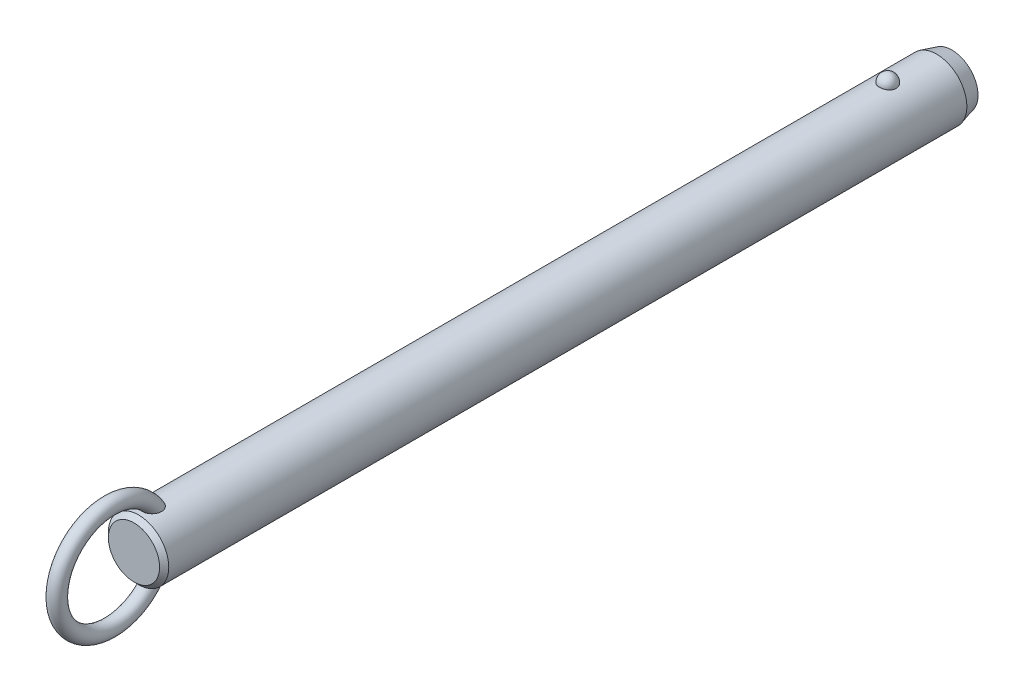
ISO-10303-21;
HEADER;
FILE_DESCRIPTION(('STEP AP214'),'2;1');
FILE_NAME('part.step','',(''),(''),'','','');
FILE_SCHEMA(('AUTOMOTIVE_DESIGN { 1 0 10303 214 1 1 1 1 }'));
ENDSEC;
DATA;
#1=APPLICATION_CONTEXT('core data for automotive mechanical design processes');
#2=APPLICATION_PROTOCOL_DEFINITION('international standard','automotive_design',2000,#1);
#3=PRODUCT_CONTEXT('',#1,'mechanical');
#4=PRODUCT('Part','Part','',(#3));
#5=PRODUCT_RELATED_PRODUCT_CATEGORY('part','',(#4));
#6=PRODUCT_DEFINITION_FORMATION('','',#4);
#7=PRODUCT_DEFINITION_CONTEXT('part definition',#1,'design');
#8=PRODUCT_DEFINITION('design','',#6,#7);
#9=PRODUCT_DEFINITION_SHAPE('','',#8);
#10=(LENGTH_UNIT() NAMED_UNIT(*) SI_UNIT(.MILLI.,.METRE.));
#11=(NAMED_UNIT(*) PLANE_ANGLE_UNIT() SI_UNIT($,.RADIAN.));
#12=(NAMED_UNIT(*) SI_UNIT($,.STERADIAN.) SOLID_ANGLE_UNIT());
#13=UNCERTAINTY_MEASURE_WITH_UNIT(LENGTH_MEASURE(1.E-05),#10,'distance_accuracy_value','');
#14=(GEOMETRIC_REPRESENTATION_CONTEXT(3) GLOBAL_UNCERTAINTY_ASSIGNED_CONTEXT((#13)) GLOBAL_UNIT_ASSIGNED_CONTEXT((#10,
#11,#12)) REPRESENTATION_CONTEXT('',''));
#15=CARTESIAN_POINT('',(0.,0.,0.));
#16=DIRECTION('',(0.,0.,1.));
#17=DIRECTION('',(1.,0.,0.));
#18=AXIS2_PLACEMENT_3D('',#15,#16,#17);
#19=CARTESIAN_POINT('',(0.,0.,185.4));
#20=DIRECTION('',(0.,0.,-1.));
#21=DIRECTION('',(-1.,0.,0.));
#22=AXIS2_PLACEMENT_3D('',#19,#20,#21);
#23=CYLINDRICAL_SURFACE('',#22,7.9);
#24=CARTESIAN_POINT('',(2.1785689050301,7.59367088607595,-2.20000000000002));
#25=CARTESIAN_POINT('',(2.17856679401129,7.59367269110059,-2.07701843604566));
#26=CARTESIAN_POINT('',(2.16853481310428,7.59657145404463,-1.95401006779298));
#27=CARTESIAN_POINT('',(2.12864689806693,7.607843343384,-1.71147811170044));
#28=CARTESIAN_POINT('',(2.09878338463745,7.61621856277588,-1.5919558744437));
#29=CARTESIAN_POINT('',(2.0199931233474,7.63749180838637,-1.35985638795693));
#30=CARTESIAN_POINT('',(1.97107475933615,7.6503878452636,-1.24727610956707));
#31=CARTESIAN_POINT('',(1.85539377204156,7.67926115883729,-1.03213234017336));
#32=CARTESIAN_POINT('',(1.78863158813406,7.69523835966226,-0.929568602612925));
#33=CARTESIAN_POINT('',(1.63856494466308,7.7285848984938,-0.73678633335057));
#34=CARTESIAN_POINT('',(1.55518140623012,7.7459606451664,-0.646630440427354));
#35=CARTESIAN_POINT('',(1.37422937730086,7.78009978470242,-0.481747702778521));
#36=CARTESIAN_POINT('',(1.27666086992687,7.79686317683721,-0.407020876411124));
#37=CARTESIAN_POINT('',(1.07024728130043,7.82786153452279,-0.275278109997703));
#38=CARTESIAN_POINT('',(0.961434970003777,7.84210353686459,-0.218212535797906));
#39=CARTESIAN_POINT('',(0.735351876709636,7.86652194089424,-0.123146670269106));
#40=CARTESIAN_POINT('',(0.618082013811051,7.87669878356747,-0.0851443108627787));
#41=CARTESIAN_POINT('',(0.380637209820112,7.89170521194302,-0.0298158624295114));
#42=CARTESIAN_POINT('',(0.260550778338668,7.89662650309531,-0.0121347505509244));
#43=CARTESIAN_POINT('',(0.0190117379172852,7.90090003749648,0.00324379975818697));
#44=CARTESIAN_POINT('',(-0.102440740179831,7.90025280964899,0.000943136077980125));
#45=CARTESIAN_POINT('',(-0.341452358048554,7.89351056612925,-0.0233955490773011));
#46=CARTESIAN_POINT('',(-0.459042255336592,7.88749257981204,-0.0451545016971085));
#47=CARTESIAN_POINT('',(-0.688796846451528,7.87075812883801,-0.107408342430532));
#48=CARTESIAN_POINT('',(-0.800961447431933,7.86004158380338,-0.14790355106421));
#49=CARTESIAN_POINT('',(-1.01743634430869,7.83497131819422,-0.246799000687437));
#50=CARTESIAN_POINT('',(-1.12169791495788,7.82059709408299,-0.305300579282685));
#51=CARTESIAN_POINT('',(-1.31891765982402,7.78976470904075,-0.43854939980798));
#52=CARTESIAN_POINT('',(-1.41187469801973,7.77330633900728,-0.513298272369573));
#53=CARTESIAN_POINT('',(-1.58577142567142,7.73972434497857,-0.678622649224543));
#54=CARTESIAN_POINT('',(-1.66645140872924,7.72259402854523,-0.769470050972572));
#55=CARTESIAN_POINT('',(-1.81161503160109,7.68983776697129,-0.963538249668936));
#56=CARTESIAN_POINT('',(-1.87609753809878,7.6742119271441,-1.0667599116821));
#57=CARTESIAN_POINT('',(-1.98790138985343,7.6460202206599,-1.28401170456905));
#58=CARTESIAN_POINT('',(-2.03501994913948,7.63349104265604,-1.39815107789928));
#59=CARTESIAN_POINT('',(-2.10986724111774,7.6131449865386,-1.6330178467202));
#60=CARTESIAN_POINT('',(-2.1375965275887,7.60532797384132,-1.75374505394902));
#61=CARTESIAN_POINT('',(-2.17289256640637,7.5953195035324,-1.99782562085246));
#62=CARTESIAN_POINT('',(-2.18054294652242,7.59310471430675,-2.12116592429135));
#63=CARTESIAN_POINT('',(-2.17572919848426,7.59448538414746,-2.36741799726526));
#64=CARTESIAN_POINT('',(-2.1632656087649,7.59808068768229,-2.49032977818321));
#65=CARTESIAN_POINT('',(-2.11865035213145,7.61064035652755,-2.73161015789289));
#66=CARTESIAN_POINT('',(-2.08659579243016,7.61957823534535,-2.84999812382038));
#67=CARTESIAN_POINT('',(-2.00367799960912,7.64179982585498,-3.07955956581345));
#68=CARTESIAN_POINT('',(-1.9528140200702,7.65508371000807,-3.19073275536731));
#69=CARTESIAN_POINT('',(-1.83321113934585,7.68460381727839,-3.40337899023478));
#70=CARTESIAN_POINT('',(-1.76437735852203,7.70085556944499,-3.5047965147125));
#71=CARTESIAN_POINT('',(-1.61069526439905,7.73445734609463,-3.69446912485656));
#72=CARTESIAN_POINT('',(-1.52584634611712,7.75180741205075,-3.78272371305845));
#73=CARTESIAN_POINT('',(-1.34198059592,7.78574608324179,-3.94393987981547));
#74=CARTESIAN_POINT('',(-1.24291308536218,7.80233167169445,-4.01684434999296));
#75=CARTESIAN_POINT('',(-1.03352039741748,7.83281625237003,-4.14489386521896));
#76=CARTESIAN_POINT('',(-0.92319600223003,7.84671543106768,-4.20004014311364));
#77=CARTESIAN_POINT('',(-0.695822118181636,7.87011575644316,-4.29042017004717));
#78=CARTESIAN_POINT('',(-0.578872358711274,7.87966903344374,-4.32589112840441));
#79=CARTESIAN_POINT('',(-0.340410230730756,7.8935652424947,-4.37692226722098));
#80=CARTESIAN_POINT('',(-0.218898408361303,7.89790879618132,-4.39248482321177));
#81=CARTESIAN_POINT('',(0.0228107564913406,7.90087453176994,-4.40314405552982));
#82=CARTESIAN_POINT('',(0.142990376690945,7.89960185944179,-4.39861683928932));
#83=CARTESIAN_POINT('',(0.380829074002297,7.89171262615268,-4.37008293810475));
#84=CARTESIAN_POINT('',(0.498488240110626,7.8850962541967,-4.34607694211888));
#85=CARTESIAN_POINT('',(0.727535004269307,7.86726442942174,-4.27939317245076));
#86=CARTESIAN_POINT('',(0.838944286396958,7.85606616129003,-4.23678512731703));
#87=CARTESIAN_POINT('',(1.05295421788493,7.83025654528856,-4.13408348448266));
#88=CARTESIAN_POINT('',(1.15555431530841,7.81564498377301,-4.07398879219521));
#89=CARTESIAN_POINT('',(1.35076763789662,7.7843022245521,-3.93687432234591));
#90=CARTESIAN_POINT('',(1.4432046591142,7.76754209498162,-3.85961036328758));
#91=CARTESIAN_POINT('',(1.6139111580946,7.73387857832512,-3.69076949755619));
#92=CARTESIAN_POINT('',(1.6921781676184,7.71697516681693,-3.59919010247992));
#93=CARTESIAN_POINT('',(1.83380875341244,7.6845643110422,-3.40247278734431));
#94=CARTESIAN_POINT('',(1.89689280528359,7.66908588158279,-3.29712873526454));
#95=CARTESIAN_POINT('',(2.0047823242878,7.64159441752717,-3.07707931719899));
#96=CARTESIAN_POINT('',(2.0495945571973,7.62958010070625,-2.96237743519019));
#97=CARTESIAN_POINT('',(2.11580183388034,7.61146617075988,-2.74040519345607));
#98=CARTESIAN_POINT('',(2.13929812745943,7.60484503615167,-2.63379846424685));
#99=CARTESIAN_POINT('',(2.17068242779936,7.59594664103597,-2.4181348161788));
#100=CARTESIAN_POINT('',(2.17857077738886,7.59366928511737,-2.30907795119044));
#101=CARTESIAN_POINT('',(2.1785689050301,7.59367088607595,-2.20000000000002));
#102=B_SPLINE_CURVE_WITH_KNOTS('',3,(#24,#25,#26,#27,#28,#29,#30,#31,#32,#33,#34,#35,#36,#37,
#38,#39,#40,#41,#42,#43,#44,#45,#46,#47,#48,#49,#50,#51,#52,#53,#54,#55,#56,#57,#58,#59,#60,#61,
#62,#63,#64,#65,#66,#67,#68,#69,#70,#71,#72,#73,#74,#75,#76,#77,#78,#79,#80,#81,#82,#83,#84,#85,
#86,#87,#88,#89,#90,#91,#92,#93,#94,#95,#96,#97,#98,#99,#100,#101),.UNSPECIFIED.,.T.,.F.,(4,2,2,
2,2,2,2,2,2,2,2,2,2,2,2,2,2,2,2,2,2,2,2,2,2,2,2,2,2,2,2,2,2,2,2,2,2,2,4),(0.,0.368552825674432,
0.737246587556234,1.10577831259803,1.4743009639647,1.8446206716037,2.21494081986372,
2.5842105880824,2.95344028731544,3.31611630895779,3.67875788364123,4.03628044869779,
4.39380913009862,4.75338791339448,5.11300280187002,5.47939989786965,5.8458226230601,
6.21639834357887,6.58696347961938,6.95598276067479,7.32499216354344,7.69218715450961,
8.0593967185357,8.42858578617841,8.79778880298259,9.16834203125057,9.5388695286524,
9.90482699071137,10.2707407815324,10.6298333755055,10.9889132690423,11.3466585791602,
11.7044262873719,12.0676511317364,12.4309391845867,12.8004764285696,13.1698767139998,
13.4967701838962,13.8236564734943),.UNSPECIFIED.);
#103=CARTESIAN_POINT('',(2.1785689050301,7.59367088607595,-2.20000000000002));
#104=VERTEX_POINT('',#103);
#105=EDGE_CURVE('E41',#104,#104,#102,.T.);
#106=ORIENTED_EDGE('',*,*,#105,.T.);
#107=EDGE_LOOP('',(#106));
#108=FACE_BOUND('',#107,.T.);
#109=CARTESIAN_POINT('',(0.,0.,193.72));
#110=DIRECTION('',(0.,0.,1.));
#111=DIRECTION('',(1.,0.,0.));
#112=AXIS2_PLACEMENT_3D('',#109,#110,#111);
#113=CIRCLE('',#112,7.9);
#114=CARTESIAN_POINT('',(7.9,0.,193.72));
#115=VERTEX_POINT('',#114);
#116=EDGE_CURVE('E10',#115,#115,#113,.F.);
#117=ORIENTED_EDGE('',*,*,#116,.T.);
#118=EDGE_LOOP('',(#117));
#119=FACE_BOUND('',#118,.T.);
#120=CARTESIAN_POINT('',(-0.630969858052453,-7.87476203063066,187.612432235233));
#121=CARTESIAN_POINT('',(-0.734180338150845,-7.86648998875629,187.647285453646));
#122=CARTESIAN_POINT('',(-0.83447695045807,-7.85639291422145,187.690816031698));
#123=CARTESIAN_POINT('',(-1.0262035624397,-7.83366343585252,187.794094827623));
#124=CARTESIAN_POINT('',(-1.1176141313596,-7.82102565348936,187.853877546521));
#125=CARTESIAN_POINT('',(-1.28877277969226,-7.79464922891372,187.987839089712));
#126=CARTESIAN_POINT('',(-1.36854014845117,-7.78091246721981,188.061993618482));
#127=CARTESIAN_POINT('',(-1.51461521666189,-7.75380398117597,188.222494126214));
#128=CARTESIAN_POINT('',(-1.58092966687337,-7.74043207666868,188.308833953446));
#129=CARTESIAN_POINT('',(-1.70019064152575,-7.7151252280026,188.492978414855));
#130=CARTESIAN_POINT('',(-1.75284037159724,-7.70322473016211,188.590979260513));
#131=CARTESIAN_POINT('',(-1.84263464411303,-7.68224112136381,188.794102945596));
#132=CARTESIAN_POINT('',(-1.87977299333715,-7.6731591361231,188.899228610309));
#133=CARTESIAN_POINT('',(-1.94152728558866,-7.65777930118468,189.123284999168));
#134=CARTESIAN_POINT('',(-1.96475471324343,-7.65179654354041,189.242616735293));
#135=CARTESIAN_POINT('',(-1.99449499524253,-7.64409642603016,189.48342986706));
#136=CARTESIAN_POINT('',(-2.0010005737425,-7.64238092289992,189.604912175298));
#137=CARTESIAN_POINT('',(-1.99856014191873,-7.64302120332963,189.868340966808));
#138=CARTESIAN_POINT('',(-1.98680021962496,-7.64611845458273,190.01025654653));
#139=CARTESIAN_POINT('',(-1.94457772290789,-7.65696186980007,190.291118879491));
#140=CARTESIAN_POINT('',(-1.91409393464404,-7.66471330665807,190.430062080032));
#141=CARTESIAN_POINT('',(-1.82768670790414,-7.68582947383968,190.731939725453));
#142=CARTESIAN_POINT('',(-1.76772963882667,-7.70003779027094,190.893686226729));
#143=CARTESIAN_POINT('',(-1.65998501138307,-7.72371550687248,191.127695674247));
#144=CARTESIAN_POINT('',(-1.621079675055,-7.73200670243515,191.204297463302));
#145=CARTESIAN_POINT('',(-1.53727726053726,-7.74910377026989,191.354079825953));
#146=CARTESIAN_POINT('',(-1.49238215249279,-7.75790947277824,191.427261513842));
#147=CARTESIAN_POINT('',(-1.37397050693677,-7.77993338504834,191.60288382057));
#148=CARTESIAN_POINT('',(-1.29690364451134,-7.79328473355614,191.702955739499));
#149=CARTESIAN_POINT('',(-1.12885487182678,-7.81939266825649,191.890714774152));
#150=CARTESIAN_POINT('',(-1.03789926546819,-7.83215032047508,191.978424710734));
#151=CARTESIAN_POINT('',(-0.869532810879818,-7.85231710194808,192.113414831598));
#152=CARTESIAN_POINT('',(-0.795716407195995,-7.86021093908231,192.165076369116));
#153=CARTESIAN_POINT('',(-0.640813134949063,-7.87434920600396,192.256381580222));
#154=CARTESIAN_POINT('',(-0.559737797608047,-7.88059619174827,192.29604389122));
#155=CARTESIAN_POINT('',(-0.406456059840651,-7.88984116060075,192.354300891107));
#156=CARTESIAN_POINT('',(-0.335227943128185,-7.89321892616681,192.375384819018));
#157=CARTESIAN_POINT('',(-0.190193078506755,-7.89804235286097,192.40541418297));
#158=CARTESIAN_POINT('',(-0.116388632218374,-7.89948969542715,192.414370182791));
#159=CARTESIAN_POINT('',(0.0318414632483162,-7.90028409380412,192.419291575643));
#160=CARTESIAN_POINT('',(0.106268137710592,-7.89962640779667,192.415227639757));
#161=CARTESIAN_POINT('',(0.253290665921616,-7.8962818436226,192.394461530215));
#162=CARTESIAN_POINT('',(0.325885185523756,-7.8935935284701,192.377750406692));
#163=CARTESIAN_POINT('',(0.481441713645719,-7.88577340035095,192.328738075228));
#164=CARTESIAN_POINT('',(0.563611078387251,-7.88026321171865,192.294005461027));
#165=CARTESIAN_POINT('',(0.721129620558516,-7.86741729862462,192.211796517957));
#166=CARTESIAN_POINT('',(0.79646633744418,-7.86007832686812,192.164297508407));
#167=CARTESIAN_POINT('',(0.971456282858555,-7.84073285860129,192.036513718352));
#168=CARTESIAN_POINT('',(1.06719686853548,-7.82809461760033,191.951004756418));
#169=CARTESIAN_POINT('',(1.24418921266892,-7.80192439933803,191.766232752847));
#170=CARTESIAN_POINT('',(1.32540832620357,-7.78839049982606,191.666939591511));
#171=CARTESIAN_POINT('',(1.45199971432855,-7.76559693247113,191.489576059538));
#172=CARTESIAN_POINT('',(1.50085649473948,-7.75626094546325,191.413954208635));
#173=CARTESIAN_POINT('',(1.59197749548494,-7.73807279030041,191.258742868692));
#174=CARTESIAN_POINT('',(1.63423919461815,-7.72922080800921,191.179151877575));
#175=CARTESIAN_POINT('',(1.71222612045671,-7.71231959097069,191.016664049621));
#176=CARTESIAN_POINT('',(1.74794516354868,-7.70427111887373,190.933764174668));
#177=CARTESIAN_POINT('',(1.81270113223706,-7.68929240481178,190.765296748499));
#178=CARTESIAN_POINT('',(1.84173789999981,-7.68236218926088,190.679729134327));
#179=CARTESIAN_POINT('',(1.89322698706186,-7.6698375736,190.50528702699));
#180=CARTESIAN_POINT('',(1.91558744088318,-7.66426199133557,190.416383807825));
#181=CARTESIAN_POINT('',(1.95281367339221,-7.65485915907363,190.236969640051));
#182=CARTESIAN_POINT('',(1.96767946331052,-7.65103190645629,190.146458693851));
#183=CARTESIAN_POINT('',(2.0002145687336,-7.64262981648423,189.873732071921));
#184=CARTESIAN_POINT('',(2.00600691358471,-7.6410871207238,189.689709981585));
#185=CARTESIAN_POINT('',(1.98445334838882,-7.64669564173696,189.376501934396));
#186=CARTESIAN_POINT('',(1.96607186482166,-7.65149688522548,189.246618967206));
#187=CARTESIAN_POINT('',(1.90884967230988,-7.66597624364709,188.991632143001));
#188=CARTESIAN_POINT('',(1.87002101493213,-7.67565148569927,188.866525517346));
#189=CARTESIAN_POINT('',(1.77063986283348,-7.69918471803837,188.62454013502));
#190=CARTESIAN_POINT('',(1.70993724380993,-7.71307150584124,188.507725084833));
#191=CARTESIAN_POINT('',(1.56733070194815,-7.74330306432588,188.288144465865));
#192=CARTESIAN_POINT('',(1.48543692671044,-7.75964665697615,188.185372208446));
#193=CARTESIAN_POINT('',(1.31346177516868,-7.79047523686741,188.009380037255));
#194=CARTESIAN_POINT('',(1.22547278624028,-7.80495298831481,187.934106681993));
#195=CARTESIAN_POINT('',(1.03724352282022,-7.83218597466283,187.800486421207));
#196=CARTESIAN_POINT('',(0.93700840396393,-7.84494192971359,187.742132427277));
#197=CARTESIAN_POINT('',(0.733599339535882,-7.86649045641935,187.647027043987));
#198=CARTESIAN_POINT('',(0.630941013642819,-7.87547134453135,187.609210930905));
#199=CARTESIAN_POINT('',(0.420465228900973,-7.88950708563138,187.551116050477));
#200=CARTESIAN_POINT('',(0.31264590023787,-7.89456050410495,187.53084369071));
#201=CARTESIAN_POINT('',(0.0960869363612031,-7.9001518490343,187.508455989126));
#202=CARTESIAN_POINT('',(-0.0126341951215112,-7.90073226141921,187.506169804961));
#203=CARTESIAN_POINT('',(-0.228766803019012,-7.89742350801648,187.519367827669));
#204=CARTESIAN_POINT('',(-0.336180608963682,-7.89354403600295,187.534813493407));
#205=CARTESIAN_POINT('',(-0.473410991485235,-7.88586871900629,187.566217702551));
#206=CARTESIAN_POINT('',(-0.50525779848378,-7.88388984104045,187.574354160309));
#207=CARTESIAN_POINT('',(-0.56848128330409,-7.87958326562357,187.592208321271));
#208=CARTESIAN_POINT('',(-0.59985795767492,-7.87725556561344,187.601926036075));
#209=CARTESIAN_POINT('',(-0.630969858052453,-7.87476203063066,187.612432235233));
#210=B_SPLINE_CURVE_WITH_KNOTS('',3,(#120,#121,#122,#123,#124,#125,#126,#127,#128,#129,#130,
#131,#132,#133,#134,#135,#136,#137,#138,#139,#140,#141,#142,#143,#144,#145,#146,#147,#148,#149,
#150,#151,#152,#153,#154,#155,#156,#157,#158,#159,#160,#161,#162,#163,#164,#165,#166,#167,#168,
#169,#170,#171,#172,#173,#174,#175,#176,#177,#178,#179,#180,#181,#182,#183,#184,#185,#186,#187,
#188,#189,#190,#191,#192,#193,#194,#195,#196,#197,#198,#199,#200,#201,#202,#203,#204,#205,#206,
#207,#208,#209),.UNSPECIFIED.,.T.,.F.,(4,2,2,2,2,2,2,2,2,2,2,2,2,2,2,2,2,2,2,2,2,2,2,2,2,2,2,2,
2,2,2,2,2,2,2,2,2,2,2,2,2,2,2,2,4),(0.,0.327622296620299,0.655945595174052,0.983718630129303,
1.3113267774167,1.64554655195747,1.97989964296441,2.34365728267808,2.70757317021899,
3.13333684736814,3.5595838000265,4.07655306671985,4.33527897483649,4.59391999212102,
4.97382437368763,5.353017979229,5.62348245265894,5.89352465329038,6.11565959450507,
6.33760092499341,6.56004255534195,6.78264174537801,7.04930844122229,7.31645206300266,
7.70130871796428,8.08701995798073,8.35824509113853,8.6295736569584,8.9011573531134,
9.1727474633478,9.44791855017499,9.72308922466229,10.2715298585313,10.6638393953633,
11.0559179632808,11.4507403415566,11.8453740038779,12.1936425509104,12.5417649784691,
12.8695063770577,13.1973674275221,13.5221104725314,13.8461490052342,13.9449071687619,
14.0436660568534),.UNSPECIFIED.);
#211=CARTESIAN_POINT('',(-0.630969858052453,-7.87476203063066,187.612432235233));
#212=VERTEX_POINT('',#211);
#213=EDGE_CURVE('E59',#212,#212,#210,.T.);
#214=ORIENTED_EDGE('',*,*,#213,.T.);
#215=EDGE_LOOP('',(#214));
#216=FACE_BOUND('',#215,.T.);
#217=CARTESIAN_POINT('',(-0.630969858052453,7.87476203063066,187.612432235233));
#218=CARTESIAN_POINT('',(-0.528918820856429,7.88293636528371,187.577979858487));
#219=CARTESIAN_POINT('',(-0.423745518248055,7.88934810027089,187.551915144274));
#220=CARTESIAN_POINT('',(-0.210236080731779,7.8979273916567,187.517282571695));
#221=CARTESIAN_POINT('',(-0.10189380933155,7.90008607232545,187.508751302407));
#222=CARTESIAN_POINT('',(0.11466056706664,7.89990877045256,187.509457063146));
#223=CARTESIAN_POINT('',(0.222872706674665,7.89757640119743,187.51867980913));
#224=CARTESIAN_POINT('',(0.436107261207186,7.88867538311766,187.554652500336));
#225=CARTESIAN_POINT('',(0.54113114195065,7.8821087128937,187.58139425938));
#226=CARTESIAN_POINT('',(0.745085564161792,7.86545130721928,187.651756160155));
#227=CARTESIAN_POINT('',(0.844015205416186,7.85536005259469,187.695378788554));
#228=CARTESIAN_POINT('',(1.03299167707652,7.83275153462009,187.798379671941));
#229=CARTESIAN_POINT('',(1.12303841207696,7.8202342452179,187.857758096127));
#230=CARTESIAN_POINT('',(1.29214734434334,7.79408219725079,187.990864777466));
#231=CARTESIAN_POINT('',(1.37116907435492,7.78044359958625,188.064643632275));
#232=CARTESIAN_POINT('',(1.51597677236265,7.75353170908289,188.224235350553));
#233=CARTESIAN_POINT('',(1.58176261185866,7.74025841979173,188.310048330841));
#234=CARTESIAN_POINT('',(1.70057386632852,7.71504069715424,188.493644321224));
#235=CARTESIAN_POINT('',(1.75320073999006,7.7031425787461,188.591690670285));
#236=CARTESIAN_POINT('',(1.8429376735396,7.68216822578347,188.794893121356));
#237=CARTESIAN_POINT('',(1.88004278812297,7.67309289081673,188.900051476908));
#238=CARTESIAN_POINT('',(1.9417232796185,7.6577294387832,189.124167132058));
#239=CARTESIAN_POINT('',(1.96491037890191,7.65175648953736,189.243524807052));
#240=CARTESIAN_POINT('',(1.9945689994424,7.64407702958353,189.484384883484));
#241=CARTESIAN_POINT('',(2.00103304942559,7.64237242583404,189.60588821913));
#242=CARTESIAN_POINT('',(1.99850166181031,7.64303650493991,189.869368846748));
#243=CARTESIAN_POINT('',(1.98669038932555,7.64614714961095,190.011314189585));
#244=CARTESIAN_POINT('',(1.94436120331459,7.65701701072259,190.292228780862));
#245=CARTESIAN_POINT('',(1.91382203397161,7.66478150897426,190.431194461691));
#246=CARTESIAN_POINT('',(1.82728754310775,7.68592483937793,190.733111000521));
#247=CARTESIAN_POINT('',(1.76725778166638,7.70014685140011,190.894872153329));
#248=CARTESIAN_POINT('',(1.65939700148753,7.72384204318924,191.128891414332));
#249=CARTESIAN_POINT('',(1.62045187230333,7.73213852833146,191.205494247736));
#250=CARTESIAN_POINT('',(1.5365668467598,7.74924489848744,191.355273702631));
#251=CARTESIAN_POINT('',(1.49162892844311,7.75805461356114,191.428451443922));
#252=CARTESIAN_POINT('',(1.37317698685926,7.78007342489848,191.603952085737));
#253=CARTESIAN_POINT('',(1.29612360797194,7.79341423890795,191.703911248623));
#254=CARTESIAN_POINT('',(1.12812043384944,7.81949839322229,191.89145083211));
#255=CARTESIAN_POINT('',(1.03719688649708,7.83224280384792,191.979054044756));
#256=CARTESIAN_POINT('',(0.868871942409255,7.85239026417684,192.11389715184));
#257=CARTESIAN_POINT('',(0.795056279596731,7.86027769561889,192.165511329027));
#258=CARTESIAN_POINT('',(0.640160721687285,7.87440222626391,192.256720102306));
#259=CARTESIAN_POINT('',(0.559092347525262,7.88064188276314,192.296333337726));
#260=CARTESIAN_POINT('',(0.405820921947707,7.8898738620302,192.354505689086));
#261=CARTESIAN_POINT('',(0.334594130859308,7.89324577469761,192.375552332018));
#262=CARTESIAN_POINT('',(0.189568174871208,7.89805733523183,192.405507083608));
#263=CARTESIAN_POINT('',(0.115771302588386,7.89949866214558,192.414425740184));
#264=CARTESIAN_POINT('',(-0.0324359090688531,7.90028156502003,192.41927589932));
#265=CARTESIAN_POINT('',(-0.106847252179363,7.89961843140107,192.415178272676));
#266=CARTESIAN_POINT('',(-0.253834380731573,7.8962642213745,192.394351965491));
#267=CARTESIAN_POINT('',(-0.326408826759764,7.89357170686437,192.377614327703));
#268=CARTESIAN_POINT('',(-0.481962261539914,7.88574179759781,192.328539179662));
#269=CARTESIAN_POINT('',(-0.564145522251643,7.88022507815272,192.293763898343));
#270=CARTESIAN_POINT('',(-0.721685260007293,7.86736646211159,192.211468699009));
#271=CARTESIAN_POINT('',(-0.797029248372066,7.8600213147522,192.163926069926));
#272=CARTESIAN_POINT('',(-0.9720442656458,7.84066026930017,192.036026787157));
#273=CARTESIAN_POINT('',(-1.06779803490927,7.82801274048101,191.950443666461));
#274=CARTESIAN_POINT('',(-1.2448053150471,7.80182621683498,191.765522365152));
#275=CARTESIAN_POINT('',(-1.32602618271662,7.78828530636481,191.666154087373));
#276=CARTESIAN_POINT('',(-1.45259834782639,7.76548487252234,191.488680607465));
#277=CARTESIAN_POINT('',(-1.50143856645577,7.75614818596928,191.413025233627));
#278=CARTESIAN_POINT('',(-1.59252410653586,7.73796020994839,191.257748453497));
#279=CARTESIAN_POINT('',(-1.63476690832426,7.72910910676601,191.178125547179));
#280=CARTESIAN_POINT('',(-1.71271318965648,7.71221133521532,191.015575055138));
#281=CARTESIAN_POINT('',(-1.74841047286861,7.70416543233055,190.932644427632));
#282=CARTESIAN_POINT('',(-1.81311929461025,7.6891937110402,190.764116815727));
#283=CARTESIAN_POINT('',(-1.84213067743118,7.68226791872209,190.678519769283));
#284=CARTESIAN_POINT('',(-1.89356259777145,7.66975461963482,190.504025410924));
#285=CARTESIAN_POINT('',(-1.91589165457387,7.66418586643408,190.415099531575));
#286=CARTESIAN_POINT('',(-1.9530507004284,7.65479859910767,190.235642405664));
#287=CARTESIAN_POINT('',(-1.96788069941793,7.65098008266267,190.145111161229));
#288=CARTESIAN_POINT('',(-2.00030078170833,7.64260704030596,189.872327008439));
#289=CARTESIAN_POINT('',(-2.00600576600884,7.64108760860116,189.688271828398));
#290=CARTESIAN_POINT('',(-1.9842848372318,7.64673945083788,189.375080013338));
#291=CARTESIAN_POINT('',(-1.96583698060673,7.65155751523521,189.245240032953));
#292=CARTESIAN_POINT('',(-1.90848948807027,7.66606613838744,188.990361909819));
#293=CARTESIAN_POINT('',(-1.86960376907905,7.67575338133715,188.865320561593));
#294=CARTESIAN_POINT('',(-1.77013421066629,7.6993013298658,188.623500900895));
#295=CARTESIAN_POINT('',(-1.70940488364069,7.71318991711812,188.506784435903));
#296=CARTESIAN_POINT('',(-1.56672953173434,7.74342495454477,188.287340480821));
#297=CARTESIAN_POINT('',(-1.48478316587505,7.75977144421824,188.18461321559));
#298=CARTESIAN_POINT('',(-1.31266325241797,7.79061163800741,188.008643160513));
#299=CARTESIAN_POINT('',(-1.22456383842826,7.80509908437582,187.933358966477));
#300=CARTESIAN_POINT('',(-1.03622400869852,7.83231881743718,187.799865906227));
#301=CARTESIAN_POINT('',(-0.936015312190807,7.84505551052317,187.741613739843));
#302=CARTESIAN_POINT('',(-0.798824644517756,7.85957802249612,187.677540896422));
#303=CARTESIAN_POINT('',(-0.765787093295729,7.86286821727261,187.663224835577));
#304=CARTESIAN_POINT('',(-0.698939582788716,7.86909211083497,187.636436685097));
#305=CARTESIAN_POINT('',(-0.66512963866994,7.8720258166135,187.623964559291));
#306=CARTESIAN_POINT('',(-0.630969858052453,7.87476203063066,187.612432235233));
#307=B_SPLINE_CURVE_WITH_KNOTS('',3,(#217,#218,#219,#220,#221,#222,#223,#224,#225,#226,#227,
#228,#229,#230,#231,#232,#233,#234,#235,#236,#237,#238,#239,#240,#241,#242,#243,#244,#245,#246,
#247,#248,#249,#250,#251,#252,#253,#254,#255,#256,#257,#258,#259,#260,#261,#262,#263,#264,#265,
#266,#267,#268,#269,#270,#271,#272,#273,#274,#275,#276,#277,#278,#279,#280,#281,#282,#283,#284,
#285,#286,#287,#288,#289,#290,#291,#292,#293,#294,#295,#296,#297,#298,#299,#300,#301,#302,#303,
#304,#305,#306),.UNSPECIFIED.,.T.,.F.,(4,2,2,2,2,2,2,2,2,2,2,2,2,2,2,2,2,2,2,2,2,2,2,2,2,2,2,2,
2,2,2,2,2,2,2,2,2,2,2,2,2,2,2,2,4),(0.,0.323920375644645,0.648516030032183,0.972850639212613,
1.29703380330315,1.62126473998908,1.94549915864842,2.27089401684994,2.5962920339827,
2.93059633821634,3.26500707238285,3.6288164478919,3.99278833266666,4.41865421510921,
4.84500434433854,5.36209210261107,5.62087589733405,5.87957448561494,6.25918598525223,
6.63808782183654,6.90846748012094,7.17842501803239,7.40052350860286,7.6224287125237,
7.84483086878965,8.06739077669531,8.33414615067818,8.60137921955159,8.98641454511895,
9.37230415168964,9.64358673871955,9.91497268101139,10.1866142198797,10.4582620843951,
10.7334745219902,11.008686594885,11.5572126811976,11.9494246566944,12.3413699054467,
12.7359755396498,13.1305875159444,13.4791770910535,13.82687259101,13.9353013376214,
14.0437279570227),.UNSPECIFIED.);
#308=CARTESIAN_POINT('',(-0.630969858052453,7.87476203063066,187.612432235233));
#309=VERTEX_POINT('',#308);
#310=EDGE_CURVE('E67',#309,#309,#307,.T.);
#311=ORIENTED_EDGE('',*,*,#310,.T.);
#312=EDGE_LOOP('',(#311));
#313=FACE_BOUND('',#312,.T.);
#314=CARTESIAN_POINT('',(0.,0.,-15.));
#315=DIRECTION('',(0.,0.,-1.));
#316=DIRECTION('',(-1.,0.,0.));
#317=AXIS2_PLACEMENT_3D('',#314,#315,#316);
#318=CIRCLE('',#317,7.9);
#319=CARTESIAN_POINT('',(-7.9,0.,-15.));
#320=VERTEX_POINT('',#319);
#321=EDGE_CURVE('E56',#320,#320,#318,.F.);
#322=ORIENTED_EDGE('',*,*,#321,.T.);
#323=EDGE_LOOP('',(#322));
#324=FACE_BOUND('',#323,.T.);
#325=ADVANCED_FACE('F37',(#108,#119,#216,#313,#324),#23,.T.);
#326=CARTESIAN_POINT('',(0.,0.,-19.));
#327=DIRECTION('',(0.,0.,-1.));
#328=DIRECTION('',(-1.,0.,0.));
#329=AXIS2_PLACEMENT_3D('',#326,#327,#328);
#330=PLANE('',#329);
#331=CARTESIAN_POINT('',(0.,0.,-19.));
#332=DIRECTION('',(0.,0.,-1.));
#333=DIRECTION('',(-1.,0.,0.));
#334=AXIS2_PLACEMENT_3D('',#331,#332,#333);
#335=CIRCLE('',#334,6.82820323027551);
#336=CARTESIAN_POINT('',(-6.82820323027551,0.,-19.));
#337=VERTEX_POINT('',#336);
#338=EDGE_CURVE('E66',#337,#337,#335,.T.);
#339=ORIENTED_EDGE('',*,*,#338,.T.);
#340=EDGE_LOOP('',(#339));
#341=FACE_BOUND('',#340,.T.);
#342=ADVANCED_FACE('F85',(#341),#330,.T.);
#343=CARTESIAN_POINT('',(0.,0.,-19.));
#344=DIRECTION('',(0.,0.,1.));
#345=DIRECTION('',(1.,0.,0.));
#346=AXIS2_PLACEMENT_3D('',#343,#344,#345);
#347=CONICAL_SURFACE('',#346,6.82820323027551,0.261799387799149);
#348=ORIENTED_EDGE('',*,*,#321,.F.);
#349=EDGE_LOOP('',(#348));
#350=FACE_BOUND('',#349,.T.);
#351=ORIENTED_EDGE('',*,*,#338,.F.);
#352=EDGE_LOOP('',(#351));
#353=FACE_BOUND('',#352,.T.);
#354=ADVANCED_FACE('F83',(#350,#353),#347,.T.);
#355=CARTESIAN_POINT('',(0.,0.,194.92));
#356=DIRECTION('',(0.,0.,1.));
#357=DIRECTION('',(1.,0.,0.));
#358=AXIS2_PLACEMENT_3D('',#355,#356,#357);
#359=PLANE('',#358);
#360=CARTESIAN_POINT('',(0.,0.,194.92));
#361=DIRECTION('',(0.,0.,1.));
#362=DIRECTION('',(1.,0.,0.));
#363=AXIS2_PLACEMENT_3D('',#360,#361,#362);
#364=CIRCLE('',#363,6.70000000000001);
#365=CARTESIAN_POINT('',(6.70000000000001,0.,194.92));
#366=VERTEX_POINT('',#365);
#367=EDGE_CURVE('E50',#366,#366,#364,.T.);
#368=ORIENTED_EDGE('',*,*,#367,.T.);
#369=EDGE_LOOP('',(#368));
#370=FACE_BOUND('',#369,.T.);
#371=ADVANCED_FACE('F77',(#370),#359,.T.);
#372=CARTESIAN_POINT('',(0.,0.,201.25));
#373=DIRECTION('',(1.,0.,0.));
#374=DIRECTION('',(0.,0.,-1.));
#375=AXIS2_PLACEMENT_3D('',#372,#373,#374);
#376=TOROIDAL_SURFACE('',#375,13.85,2.);
#377=ORIENTED_EDGE('',*,*,#310,.F.);
#378=EDGE_LOOP('',(#377));
#379=FACE_BOUND('',#378,.T.);
#380=ORIENTED_EDGE('',*,*,#213,.F.);
#381=EDGE_LOOP('',(#380));
#382=FACE_BOUND('',#381,.T.);
#383=ADVANCED_FACE('F73',(#379,#382),#376,.T.);
#384=CARTESIAN_POINT('',(0.,0.,194.92));
#385=DIRECTION('',(0.,0.,-1.));
#386=DIRECTION('',(-1.,0.,0.));
#387=AXIS2_PLACEMENT_3D('',#384,#385,#386);
#388=CONICAL_SURFACE('',#387,6.70000000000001,0.785398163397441);
#389=ORIENTED_EDGE('',*,*,#116,.F.);
#390=EDGE_LOOP('',(#389));
#391=FACE_BOUND('',#390,.T.);
#392=ORIENTED_EDGE('',*,*,#367,.F.);
#393=EDGE_LOOP('',(#392));
#394=FACE_BOUND('',#393,.T.);
#395=ADVANCED_FACE('F39',(#391,#394),#388,.T.);
#396=CARTESIAN_POINT('',(0.,7.9,-2.20000000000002));
#397=DIRECTION('',(0.,1.,0.));
#398=DIRECTION('',(0.,0.,-1.));
#399=AXIS2_PLACEMENT_3D('',#396,#397,#398);
#400=SPHERICAL_SURFACE('',#399,2.2);
#401=ORIENTED_EDGE('',*,*,#105,.F.);
#402=EDGE_LOOP('',(#401));
#403=FACE_BOUND('',#402,.T.);
#404=ADVANCED_FACE('F79',(#403),#400,.T.);
#405=CLOSED_SHELL('',(#325,#342,#354,#371,#383,#395,#404));
#406=MANIFOLD_SOLID_BREP('B2',#405);
#407=ADVANCED_BREP_SHAPE_REPRESENTATION('',(#18,#406),#14);
#408=SHAPE_DEFINITION_REPRESENTATION(#9,#407);
ENDSEC;
END-ISO-10303-21;
